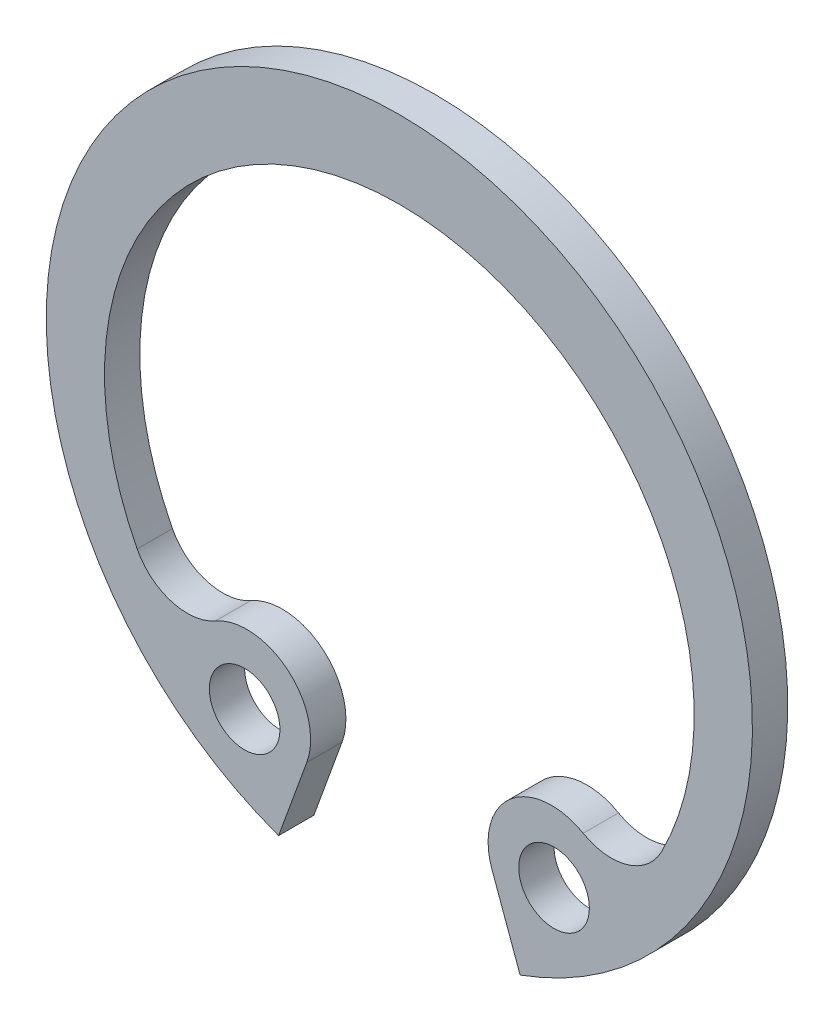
ISO-10303-21;
HEADER;
FILE_DESCRIPTION(('STEP AP214'),'2;1');
FILE_NAME('part.step','',(''),(''),'','','');
FILE_SCHEMA(('AUTOMOTIVE_DESIGN { 1 0 10303 214 1 1 1 1 }'));
ENDSEC;
DATA;
#1=APPLICATION_CONTEXT('core data for automotive mechanical design processes');
#2=APPLICATION_PROTOCOL_DEFINITION('international standard','automotive_design',2000,#1);
#3=PRODUCT_CONTEXT('',#1,'mechanical');
#4=PRODUCT('Part','Part','',(#3));
#5=PRODUCT_RELATED_PRODUCT_CATEGORY('part','',(#4));
#6=PRODUCT_DEFINITION_FORMATION('','',#4);
#7=PRODUCT_DEFINITION_CONTEXT('part definition',#1,'design');
#8=PRODUCT_DEFINITION('design','',#6,#7);
#9=PRODUCT_DEFINITION_SHAPE('','',#8);
#10=(LENGTH_UNIT() NAMED_UNIT(*) SI_UNIT(.MILLI.,.METRE.));
#11=(NAMED_UNIT(*) PLANE_ANGLE_UNIT() SI_UNIT($,.RADIAN.));
#12=(NAMED_UNIT(*) SI_UNIT($,.STERADIAN.) SOLID_ANGLE_UNIT());
#13=UNCERTAINTY_MEASURE_WITH_UNIT(LENGTH_MEASURE(1.E-05),#10,'distance_accuracy_value','');
#14=(GEOMETRIC_REPRESENTATION_CONTEXT(3) GLOBAL_UNCERTAINTY_ASSIGNED_CONTEXT((#13)) GLOBAL_UNIT_ASSIGNED_CONTEXT((#10,
#11,#12)) REPRESENTATION_CONTEXT('',''));
#15=CARTESIAN_POINT('',(0.,0.,0.));
#16=DIRECTION('',(0.,0.,1.));
#17=DIRECTION('',(1.,0.,0.));
#18=AXIS2_PLACEMENT_3D('',#15,#16,#17);
#19=CARTESIAN_POINT('',(0.,0.,0.));
#20=DIRECTION('',(0.,0.,-1.));
#21=DIRECTION('',(-1.,0.,0.));
#22=AXIS2_PLACEMENT_3D('',#19,#20,#21);
#23=PLANE('',#22);
#24=CARTESIAN_POINT('',(4.38133656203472,-6.77477535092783,0.));
#25=DIRECTION('',(0.,0.,1.));
#26=DIRECTION('',(1.,0.,0.));
#27=AXIS2_PLACEMENT_3D('',#24,#25,#26);
#28=CIRCLE('',#27,1.);
#29=CARTESIAN_POINT('',(5.38133656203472,-6.77477535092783,0.));
#30=VERTEX_POINT('',#29);
#31=EDGE_CURVE('E134',#30,#30,#28,.T.);
#32=ORIENTED_EDGE('',*,*,#31,.T.);
#33=EDGE_LOOP('',(#32));
#34=FACE_BOUND('',#33,.T.);
#35=CARTESIAN_POINT('',(4.31293253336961,-6.58683682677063,0.));
#36=DIRECTION('',(0.,0.,1.));
#37=DIRECTION('',(1.,0.,0.));
#38=AXIS2_PLACEMENT_3D('',#35,#36,#37);
#39=CIRCLE('',#38,1.8);
#40=CARTESIAN_POINT('',(5.20764537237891,-5.02495048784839,0.));
#41=VERTEX_POINT('',#40);
#42=CARTESIAN_POINT('',(2.62148581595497,-7.20247308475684,0.));
#43=VERTEX_POINT('',#42);
#44=EDGE_CURVE('E141',#41,#43,#39,.T.);
#45=ORIENTED_EDGE('',*,*,#44,.F.);
#46=CARTESIAN_POINT('',(6.0029456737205,-3.63660707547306,0.));
#47=DIRECTION('',(0.,0.,-1.));
#48=DIRECTION('',(-1.,0.,0.));
#49=AXIS2_PLACEMENT_3D('',#46,#47,#48);
#50=CIRCLE('',#49,1.6);
#51=CARTESIAN_POINT('',(7.42586612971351,-4.36824727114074,0.));
#52=VERTEX_POINT('',#51);
#53=EDGE_CURVE('E145',#41,#52,#50,.F.);
#54=ORIENTED_EDGE('',*,*,#53,.T.);
#55=CARTESIAN_POINT('',(0.,-0.55,0.));
#56=DIRECTION('',(0.,0.,1.));
#57=DIRECTION('',(1.,0.,0.));
#58=AXIS2_PLACEMENT_3D('',#55,#56,#57);
#59=CIRCLE('',#58,8.35);
#60=CARTESIAN_POINT('',(-7.42586612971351,-4.36824727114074,0.));
#61=VERTEX_POINT('',#60);
#62=EDGE_CURVE('E86',#52,#61,#59,.T.);
#63=ORIENTED_EDGE('',*,*,#62,.T.);
#64=CARTESIAN_POINT('',(-6.0029456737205,-3.63660707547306,0.));
#65=DIRECTION('',(0.,0.,-1.));
#66=DIRECTION('',(-1.,0.,0.));
#67=AXIS2_PLACEMENT_3D('',#64,#65,#66);
#68=CIRCLE('',#67,1.6);
#69=CARTESIAN_POINT('',(-5.20764537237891,-5.02495048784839,0.));
#70=VERTEX_POINT('',#69);
#71=EDGE_CURVE('E83',#61,#70,#68,.F.);
#72=ORIENTED_EDGE('',*,*,#71,.T.);
#73=CARTESIAN_POINT('',(-4.31293253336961,-6.58683682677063,0.));
#74=DIRECTION('',(0.,0.,1.));
#75=DIRECTION('',(1.,0.,0.));
#76=AXIS2_PLACEMENT_3D('',#73,#74,#75);
#77=CIRCLE('',#76,1.8);
#78=CARTESIAN_POINT('',(-2.62148581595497,-7.20247308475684,0.));
#79=VERTEX_POINT('',#78);
#80=EDGE_CURVE('E80',#79,#70,#77,.T.);
#81=ORIENTED_EDGE('',*,*,#80,.F.);
#82=DIRECTION('',(0.342020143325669,0.939692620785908,0.));
#83=VECTOR('',#82,1.);
#84=CARTESIAN_POINT('',(0.,0.,0.));
#85=LINE('',#84,#83);
#86=CARTESIAN_POINT('',(-3.42020143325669,-9.39692620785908,0.));
#87=VERTEX_POINT('',#86);
#88=EDGE_CURVE('E98',#87,#79,#85,.T.);
#89=ORIENTED_EDGE('',*,*,#88,.F.);
#90=CARTESIAN_POINT('',(0.,0.,0.));
#91=DIRECTION('',(0.,0.,1.));
#92=DIRECTION('',(1.,0.,0.));
#93=AXIS2_PLACEMENT_3D('',#90,#91,#92);
#94=CIRCLE('',#93,10.);
#95=CARTESIAN_POINT('',(3.42020143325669,-9.39692620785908,0.));
#96=VERTEX_POINT('',#95);
#97=EDGE_CURVE('E137',#96,#87,#94,.T.);
#98=ORIENTED_EDGE('',*,*,#97,.F.);
#99=DIRECTION('',(0.342020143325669,-0.939692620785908,0.));
#100=VECTOR('',#99,1.);
#101=CARTESIAN_POINT('',(0.,0.,0.));
#102=LINE('',#101,#100);
#103=EDGE_CURVE('E110',#43,#96,#102,.T.);
#104=ORIENTED_EDGE('',*,*,#103,.F.);
#105=EDGE_LOOP('',(#45,#54,#63,#72,#81,#89,#98,#104));
#106=FACE_BOUND('',#105,.T.);
#107=CARTESIAN_POINT('',(-4.38133656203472,-6.77477535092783,0.));
#108=DIRECTION('',(0.,0.,1.));
#109=DIRECTION('',(1.,0.,0.));
#110=AXIS2_PLACEMENT_3D('',#107,#108,#109);
#111=CIRCLE('',#110,1.);
#112=CARTESIAN_POINT('',(-3.38133656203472,-6.77477535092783,0.));
#113=VERTEX_POINT('',#112);
#114=EDGE_CURVE('E20',#113,#113,#111,.T.);
#115=ORIENTED_EDGE('',*,*,#114,.T.);
#116=EDGE_LOOP('',(#115));
#117=FACE_BOUND('',#116,.T.);
#118=ADVANCED_FACE('F17',(#34,#106,#117),#23,.T.);
#119=CARTESIAN_POINT('',(-4.38133656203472,-6.77477535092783,0.));
#120=DIRECTION('',(0.,0.,1.));
#121=DIRECTION('',(1.,0.,0.));
#122=AXIS2_PLACEMENT_3D('',#119,#120,#121);
#123=CYLINDRICAL_SURFACE('',#122,1.);
#124=ORIENTED_EDGE('',*,*,#114,.F.);
#125=EDGE_LOOP('',(#124));
#126=FACE_BOUND('',#125,.T.);
#127=CARTESIAN_POINT('',(-4.38133656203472,-6.77477535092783,1.));
#128=DIRECTION('',(0.,0.,1.));
#129=DIRECTION('',(1.,0.,0.));
#130=AXIS2_PLACEMENT_3D('',#127,#128,#129);
#131=CIRCLE('',#130,1.);
#132=CARTESIAN_POINT('',(-3.38133656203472,-6.77477535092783,1.));
#133=VERTEX_POINT('',#132);
#134=EDGE_CURVE('E131',#133,#133,#131,.F.);
#135=ORIENTED_EDGE('',*,*,#134,.F.);
#136=EDGE_LOOP('',(#135));
#137=FACE_BOUND('',#136,.T.);
#138=ADVANCED_FACE('F178',(#126,#137),#123,.F.);
#139=CARTESIAN_POINT('',(0.,0.,0.5));
#140=DIRECTION('',(0.939692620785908,-0.342020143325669,0.));
#141=DIRECTION('',(0.342020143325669,0.939692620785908,0.));
#142=AXIS2_PLACEMENT_3D('',#139,#140,#141);
#143=PLANE('',#142);
#144=DIRECTION('',(0.342020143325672,0.939692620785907,0.));
#145=VECTOR('',#144,1.);
#146=CARTESIAN_POINT('',(-3.42020143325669,-9.39692620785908,1.));
#147=LINE('',#146,#145);
#148=CARTESIAN_POINT('',(-3.42020143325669,-9.39692620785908,1.));
#149=VERTEX_POINT('',#148);
#150=CARTESIAN_POINT('',(-2.62148581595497,-7.20247308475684,1.));
#151=VERTEX_POINT('',#150);
#152=EDGE_CURVE('E130',#149,#151,#147,.T.);
#153=ORIENTED_EDGE('',*,*,#152,.F.);
#154=DIRECTION('',(0.,0.,1.));
#155=VECTOR('',#154,1.);
#156=CARTESIAN_POINT('',(-3.42020143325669,-9.39692620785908,0.));
#157=LINE('',#156,#155);
#158=EDGE_CURVE('E140',#87,#149,#157,.T.);
#159=ORIENTED_EDGE('',*,*,#158,.F.);
#160=ORIENTED_EDGE('',*,*,#88,.T.);
#161=DIRECTION('',(0.,0.,1.));
#162=VECTOR('',#161,1.);
#163=CARTESIAN_POINT('',(-2.62148581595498,-7.20247308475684,0.));
#164=LINE('',#163,#162);
#165=EDGE_CURVE('E91',#151,#79,#164,.F.);
#166=ORIENTED_EDGE('',*,*,#165,.F.);
#167=EDGE_LOOP('',(#153,#159,#160,#166));
#168=FACE_BOUND('',#167,.T.);
#169=ADVANCED_FACE('F176',(#168),#143,.T.);
#170=CARTESIAN_POINT('',(-4.31293253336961,-6.58683682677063,0.));
#171=DIRECTION('',(0.,0.,1.));
#172=DIRECTION('',(1.,0.,0.));
#173=AXIS2_PLACEMENT_3D('',#170,#171,#172);
#174=CYLINDRICAL_SURFACE('',#173,1.8);
#175=CARTESIAN_POINT('',(-4.31293253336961,-6.58683682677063,1.));
#176=DIRECTION('',(0.,0.,1.));
#177=DIRECTION('',(1.,0.,0.));
#178=AXIS2_PLACEMENT_3D('',#175,#176,#177);
#179=CIRCLE('',#178,1.8);
#180=CARTESIAN_POINT('',(-5.20764537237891,-5.02495048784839,1.));
#181=VERTEX_POINT('',#180);
#182=EDGE_CURVE('E128',#151,#181,#179,.T.);
#183=ORIENTED_EDGE('',*,*,#182,.F.);
#184=ORIENTED_EDGE('',*,*,#165,.T.);
#185=ORIENTED_EDGE('',*,*,#80,.T.);
#186=DIRECTION('',(0.,0.,-1.));
#187=VECTOR('',#186,1.);
#188=CARTESIAN_POINT('',(-5.20764537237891,-5.02495048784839,0.));
#189=LINE('',#188,#187);
#190=EDGE_CURVE('E90',#70,#181,#189,.F.);
#191=ORIENTED_EDGE('',*,*,#190,.T.);
#192=EDGE_LOOP('',(#183,#184,#185,#191));
#193=FACE_BOUND('',#192,.T.);
#194=ADVANCED_FACE('F96',(#193),#174,.T.);
#195=CARTESIAN_POINT('',(-6.0029456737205,-3.63660707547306,0.));
#196=DIRECTION('',(0.,0.,-1.));
#197=DIRECTION('',(-1.,0.,0.));
#198=AXIS2_PLACEMENT_3D('',#195,#196,#197);
#199=CYLINDRICAL_SURFACE('',#198,1.6);
#200=ORIENTED_EDGE('',*,*,#190,.F.);
#201=ORIENTED_EDGE('',*,*,#71,.F.);
#202=DIRECTION('',(0.,0.,1.));
#203=VECTOR('',#202,1.);
#204=CARTESIAN_POINT('',(-7.42586612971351,-4.36824727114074,0.));
#205=LINE('',#204,#203);
#206=CARTESIAN_POINT('',(-7.42586612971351,-4.36824727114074,1.));
#207=VERTEX_POINT('',#206);
#208=EDGE_CURVE('E104',#61,#207,#205,.T.);
#209=ORIENTED_EDGE('',*,*,#208,.T.);
#210=CARTESIAN_POINT('',(-6.0029456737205,-3.63660707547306,1.));
#211=DIRECTION('',(0.,0.,-1.));
#212=DIRECTION('',(-1.,0.,0.));
#213=AXIS2_PLACEMENT_3D('',#210,#211,#212);
#214=CIRCLE('',#213,1.6);
#215=EDGE_CURVE('E101',#181,#207,#214,.T.);
#216=ORIENTED_EDGE('',*,*,#215,.F.);
#217=EDGE_LOOP('',(#200,#201,#209,#216));
#218=FACE_BOUND('',#217,.T.);
#219=ADVANCED_FACE('F99',(#218),#199,.F.);
#220=CARTESIAN_POINT('',(0.,-0.55,0.));
#221=DIRECTION('',(0.,0.,1.));
#222=DIRECTION('',(1.,0.,0.));
#223=AXIS2_PLACEMENT_3D('',#220,#221,#222);
#224=CYLINDRICAL_SURFACE('',#223,8.35);
#225=ORIENTED_EDGE('',*,*,#208,.F.);
#226=ORIENTED_EDGE('',*,*,#62,.F.);
#227=DIRECTION('',(0.,0.,-1.));
#228=VECTOR('',#227,1.);
#229=CARTESIAN_POINT('',(7.42586612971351,-4.36824727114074,0.));
#230=LINE('',#229,#228);
#231=CARTESIAN_POINT('',(7.42586612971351,-4.36824727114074,1.));
#232=VERTEX_POINT('',#231);
#233=EDGE_CURVE('E144',#52,#232,#230,.F.);
#234=ORIENTED_EDGE('',*,*,#233,.T.);
#235=CARTESIAN_POINT('',(0.,-0.55,1.));
#236=DIRECTION('',(0.,0.,1.));
#237=DIRECTION('',(1.,0.,0.));
#238=AXIS2_PLACEMENT_3D('',#235,#236,#237);
#239=CIRCLE('',#238,8.35);
#240=EDGE_CURVE('E124',#207,#232,#239,.F.);
#241=ORIENTED_EDGE('',*,*,#240,.F.);
#242=EDGE_LOOP('',(#225,#226,#234,#241));
#243=FACE_BOUND('',#242,.T.);
#244=ADVANCED_FACE('F149',(#243),#224,.F.);
#245=CARTESIAN_POINT('',(6.0029456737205,-3.63660707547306,0.));
#246=DIRECTION('',(0.,0.,-1.));
#247=DIRECTION('',(-1.,0.,0.));
#248=AXIS2_PLACEMENT_3D('',#245,#246,#247);
#249=CYLINDRICAL_SURFACE('',#248,1.6);
#250=ORIENTED_EDGE('',*,*,#233,.F.);
#251=ORIENTED_EDGE('',*,*,#53,.F.);
#252=DIRECTION('',(0.,0.,1.));
#253=VECTOR('',#252,1.);
#254=CARTESIAN_POINT('',(5.20764537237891,-5.02495048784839,0.));
#255=LINE('',#254,#253);
#256=CARTESIAN_POINT('',(5.20764537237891,-5.02495048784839,1.));
#257=VERTEX_POINT('',#256);
#258=EDGE_CURVE('E113',#257,#41,#255,.F.);
#259=ORIENTED_EDGE('',*,*,#258,.F.);
#260=CARTESIAN_POINT('',(6.0029456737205,-3.63660707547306,1.));
#261=DIRECTION('',(0.,0.,-1.));
#262=DIRECTION('',(-1.,0.,0.));
#263=AXIS2_PLACEMENT_3D('',#260,#261,#262);
#264=CIRCLE('',#263,1.6);
#265=EDGE_CURVE('E121',#232,#257,#264,.T.);
#266=ORIENTED_EDGE('',*,*,#265,.F.);
#267=EDGE_LOOP('',(#250,#251,#259,#266));
#268=FACE_BOUND('',#267,.T.);
#269=ADVANCED_FACE('F172',(#268),#249,.F.);
#270=CARTESIAN_POINT('',(4.31293253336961,-6.58683682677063,0.));
#271=DIRECTION('',(0.,0.,1.));
#272=DIRECTION('',(1.,0.,0.));
#273=AXIS2_PLACEMENT_3D('',#270,#271,#272);
#274=CYLINDRICAL_SURFACE('',#273,1.8);
#275=CARTESIAN_POINT('',(4.31293253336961,-6.58683682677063,1.));
#276=DIRECTION('',(0.,0.,1.));
#277=DIRECTION('',(1.,0.,0.));
#278=AXIS2_PLACEMENT_3D('',#275,#276,#277);
#279=CIRCLE('',#278,1.8);
#280=CARTESIAN_POINT('',(2.62148581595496,-7.20247308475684,1.));
#281=VERTEX_POINT('',#280);
#282=EDGE_CURVE('E118',#257,#281,#279,.T.);
#283=ORIENTED_EDGE('',*,*,#282,.F.);
#284=ORIENTED_EDGE('',*,*,#258,.T.);
#285=ORIENTED_EDGE('',*,*,#44,.T.);
#286=DIRECTION('',(0.,0.,1.));
#287=VECTOR('',#286,1.);
#288=CARTESIAN_POINT('',(2.62148581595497,-7.20247308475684,0.5));
#289=LINE('',#288,#287);
#290=EDGE_CURVE('E112',#281,#43,#289,.F.);
#291=ORIENTED_EDGE('',*,*,#290,.F.);
#292=EDGE_LOOP('',(#283,#284,#285,#291));
#293=FACE_BOUND('',#292,.T.);
#294=ADVANCED_FACE('F170',(#293),#274,.T.);
#295=CARTESIAN_POINT('',(0.,0.,0.5));
#296=DIRECTION('',(-0.939692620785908,-0.342020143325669,0.));
#297=DIRECTION('',(0.342020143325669,-0.939692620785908,0.));
#298=AXIS2_PLACEMENT_3D('',#295,#296,#297);
#299=PLANE('',#298);
#300=DIRECTION('',(0.342020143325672,-0.939692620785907,0.));
#301=VECTOR('',#300,1.);
#302=CARTESIAN_POINT('',(2.62148581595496,-7.20247308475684,1.));
#303=LINE('',#302,#301);
#304=CARTESIAN_POINT('',(3.42020143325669,-9.39692620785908,1.));
#305=VERTEX_POINT('',#304);
#306=EDGE_CURVE('E117',#281,#305,#303,.T.);
#307=ORIENTED_EDGE('',*,*,#306,.F.);
#308=ORIENTED_EDGE('',*,*,#290,.T.);
#309=ORIENTED_EDGE('',*,*,#103,.T.);
#310=DIRECTION('',(0.,0.,1.));
#311=VECTOR('',#310,1.);
#312=CARTESIAN_POINT('',(3.42020143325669,-9.39692620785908,0.));
#313=LINE('',#312,#311);
#314=EDGE_CURVE('E35',#305,#96,#313,.F.);
#315=ORIENTED_EDGE('',*,*,#314,.F.);
#316=EDGE_LOOP('',(#307,#308,#309,#315));
#317=FACE_BOUND('',#316,.T.);
#318=ADVANCED_FACE('F173',(#317),#299,.T.);
#319=CARTESIAN_POINT('',(0.,0.,0.));
#320=DIRECTION('',(0.,0.,1.));
#321=DIRECTION('',(1.,0.,0.));
#322=AXIS2_PLACEMENT_3D('',#319,#320,#321);
#323=CYLINDRICAL_SURFACE('',#322,10.);
#324=CARTESIAN_POINT('',(0.,0.,1.));
#325=DIRECTION('',(0.,0.,1.));
#326=DIRECTION('',(1.,0.,0.));
#327=AXIS2_PLACEMENT_3D('',#324,#325,#326);
#328=CIRCLE('',#327,10.);
#329=EDGE_CURVE('E26',#305,#149,#328,.T.);
#330=ORIENTED_EDGE('',*,*,#329,.F.);
#331=ORIENTED_EDGE('',*,*,#314,.T.);
#332=ORIENTED_EDGE('',*,*,#97,.T.);
#333=ORIENTED_EDGE('',*,*,#158,.T.);
#334=EDGE_LOOP('',(#330,#331,#332,#333));
#335=FACE_BOUND('',#334,.T.);
#336=ADVANCED_FACE('F175',(#335),#323,.T.);
#337=CARTESIAN_POINT('',(4.38133656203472,-6.77477535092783,0.));
#338=DIRECTION('',(0.,0.,1.));
#339=DIRECTION('',(1.,0.,0.));
#340=AXIS2_PLACEMENT_3D('',#337,#338,#339);
#341=CYLINDRICAL_SURFACE('',#340,1.);
#342=ORIENTED_EDGE('',*,*,#31,.F.);
#343=EDGE_LOOP('',(#342));
#344=FACE_BOUND('',#343,.T.);
#345=CARTESIAN_POINT('',(4.38133656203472,-6.77477535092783,1.));
#346=DIRECTION('',(0.,0.,1.));
#347=DIRECTION('',(1.,0.,0.));
#348=AXIS2_PLACEMENT_3D('',#345,#346,#347);
#349=CIRCLE('',#348,1.);
#350=CARTESIAN_POINT('',(5.38133656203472,-6.77477535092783,1.));
#351=VERTEX_POINT('',#350);
#352=EDGE_CURVE('E11',#351,#351,#349,.F.);
#353=ORIENTED_EDGE('',*,*,#352,.F.);
#354=EDGE_LOOP('',(#353));
#355=FACE_BOUND('',#354,.T.);
#356=ADVANCED_FACE('F188',(#344,#355),#341,.F.);
#357=CARTESIAN_POINT('',(0.,0.,1.));
#358=DIRECTION('',(0.,0.,1.));
#359=DIRECTION('',(1.,0.,0.));
#360=AXIS2_PLACEMENT_3D('',#357,#358,#359);
#361=PLANE('',#360);
#362=ORIENTED_EDGE('',*,*,#352,.T.);
#363=EDGE_LOOP('',(#362));
#364=FACE_BOUND('',#363,.T.);
#365=ORIENTED_EDGE('',*,*,#306,.T.);
#366=ORIENTED_EDGE('',*,*,#329,.T.);
#367=ORIENTED_EDGE('',*,*,#152,.T.);
#368=ORIENTED_EDGE('',*,*,#182,.T.);
#369=ORIENTED_EDGE('',*,*,#215,.T.);
#370=ORIENTED_EDGE('',*,*,#240,.T.);
#371=ORIENTED_EDGE('',*,*,#265,.T.);
#372=ORIENTED_EDGE('',*,*,#282,.T.);
#373=EDGE_LOOP('',(#365,#366,#367,#368,#369,#370,#371,#372));
#374=FACE_BOUND('',#373,.T.);
#375=ORIENTED_EDGE('',*,*,#134,.T.);
#376=EDGE_LOOP('',(#375));
#377=FACE_BOUND('',#376,.T.);
#378=ADVANCED_FACE('F154',(#364,#374,#377),#361,.T.);
#379=CLOSED_SHELL('',(#118,#138,#169,#194,#219,#244,#269,#294,#318,#336,#356,#378));
#380=MANIFOLD_SOLID_BREP('B1',#379);
#381=ADVANCED_BREP_SHAPE_REPRESENTATION('',(#18,#380),#14);
#382=SHAPE_DEFINITION_REPRESENTATION(#9,#381);
ENDSEC;
END-ISO-10303-21;
